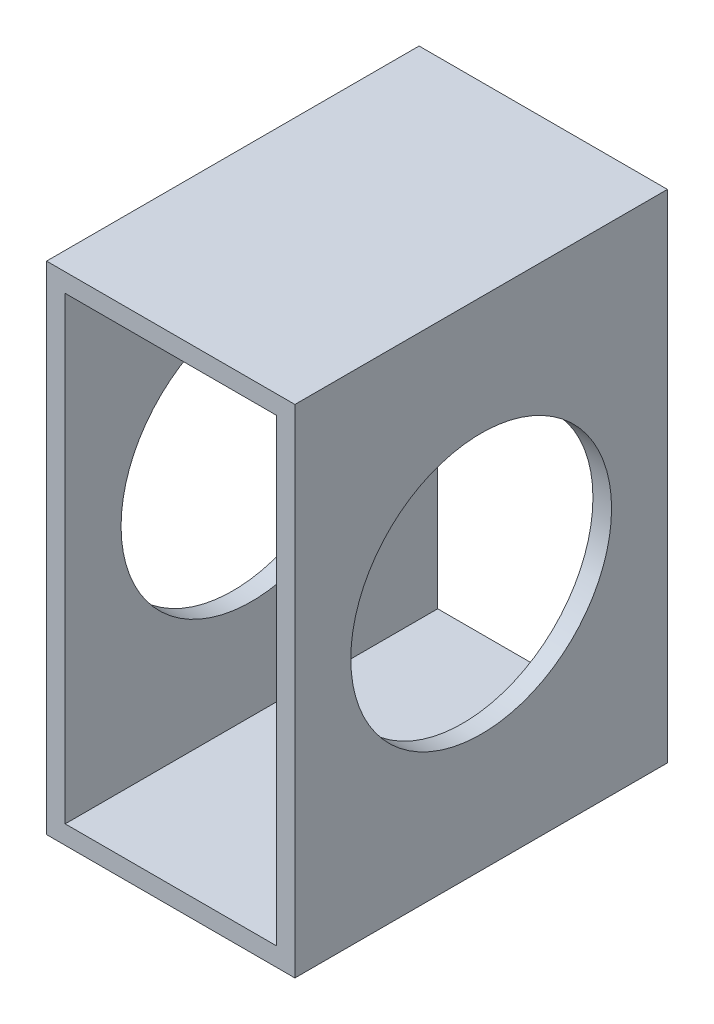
from build123d import *

# Parameters (mm, degrees)
SCHIZZO1_W                   = 40
SCHIZZO1_H                   = 80
SCHIZZO1_W_2                 = 34
SCHIZZO1_H_2                 = 74
ESTRUSIONE_ESTRUSIONE1_DEPTH = 30
TAGLIO_ESTRUSIONE1_REACH     = 66.031
SCHIZZO2_R                   = 21


with BuildPart() as part:
    # Schizzo1 → Estrusione-Estrusione1 (new, symmetric)
    with BuildSketch(Plane.XY):
        Rectangle(SCHIZZO1_W, SCHIZZO1_H)
        Rectangle(SCHIZZO1_W_2, SCHIZZO1_H_2, mode=Mode.SUBTRACT)
    extrude(amount=ESTRUSIONE_ESTRUSIONE1_DEPTH, both=True)

    # Taglio-Estrusione1: up to this face of the body (flat: up to its plane)
    taglio_estrusione1_end = Plane(part.part.faces().sort_by_distance((-20, 0, 0))[0])
    # Schizzo2 → Taglio-Estrusione1 (cut, up to the picked face)
    with BuildSketch(Plane(origin=(20, 0, 0), x_dir=(0, 0, -1), z_dir=(1, 0, 0)), mode=Mode.PRIVATE) as taglio_estrusione1_sk1:
        Circle(SCHIZZO2_R)
    taglio_estrusione1_tool1 = split(extrude(taglio_estrusione1_sk1.sketch, amount=-TAGLIO_ESTRUSIONE1_REACH, mode=Mode.PRIVATE), bisect_by=taglio_estrusione1_end, keep=Keep.BOTH, mode=Mode.PRIVATE)
    add(taglio_estrusione1_tool1.solids().sort_by(Axis((20, 0, 0), (-1, 0, 0)))[0], mode=Mode.SUBTRACT)


solid = part.part
